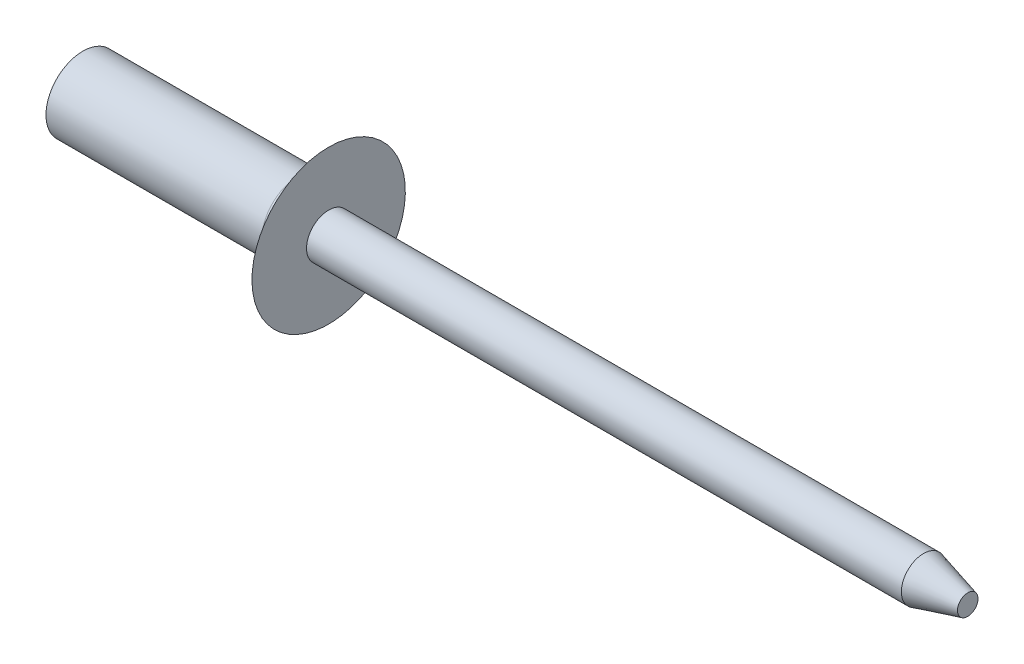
ISO-10303-21;
HEADER;
FILE_DESCRIPTION(('STEP AP214'),'2;1');
FILE_NAME('part.step','',(''),(''),'','','');
FILE_SCHEMA(('AUTOMOTIVE_DESIGN { 1 0 10303 214 1 1 1 1 }'));
ENDSEC;
DATA;
#1=APPLICATION_CONTEXT('core data for automotive mechanical design processes');
#2=APPLICATION_PROTOCOL_DEFINITION('international standard','automotive_design',2000,#1);
#3=PRODUCT_CONTEXT('',#1,'mechanical');
#4=PRODUCT('Part','Part','',(#3));
#5=PRODUCT_RELATED_PRODUCT_CATEGORY('part','',(#4));
#6=PRODUCT_DEFINITION_FORMATION('','',#4);
#7=PRODUCT_DEFINITION_CONTEXT('part definition',#1,'design');
#8=PRODUCT_DEFINITION('design','',#6,#7);
#9=PRODUCT_DEFINITION_SHAPE('','',#8);
#10=(LENGTH_UNIT() NAMED_UNIT(*) SI_UNIT(.MILLI.,.METRE.));
#11=(NAMED_UNIT(*) PLANE_ANGLE_UNIT() SI_UNIT($,.RADIAN.));
#12=(NAMED_UNIT(*) SI_UNIT($,.STERADIAN.) SOLID_ANGLE_UNIT());
#13=UNCERTAINTY_MEASURE_WITH_UNIT(LENGTH_MEASURE(1.E-05),#10,'distance_accuracy_value','');
#14=(GEOMETRIC_REPRESENTATION_CONTEXT(3) GLOBAL_UNCERTAINTY_ASSIGNED_CONTEXT((#13)) GLOBAL_UNIT_ASSIGNED_CONTEXT((#10,
#11,#12)) REPRESENTATION_CONTEXT('',''));
#15=CARTESIAN_POINT('',(0.,0.,0.));
#16=DIRECTION('',(0.,0.,1.));
#17=DIRECTION('',(1.,0.,0.));
#18=AXIS2_PLACEMENT_3D('',#15,#16,#17);
#19=CARTESIAN_POINT('',(0.,0.,0.));
#20=DIRECTION('',(1.,0.,0.));
#21=DIRECTION('',(0.,1.,0.));
#22=AXIS2_PLACEMENT_3D('',#19,#20,#21);
#23=PLANE('',#22);
#24=CARTESIAN_POINT('',(0.,0.,0.));
#25=DIRECTION('',(1.,0.,0.));
#26=DIRECTION('',(0.,1.,0.));
#27=AXIS2_PLACEMENT_3D('',#24,#25,#26);
#28=CIRCLE('',#27,1.5);
#29=CARTESIAN_POINT('',(0.,1.5,0.));
#30=VERTEX_POINT('',#29);
#31=EDGE_CURVE('E51',#30,#30,#28,.T.);
#32=ORIENTED_EDGE('',*,*,#31,.F.);
#33=EDGE_LOOP('',(#32));
#34=FACE_BOUND('',#33,.T.);
#35=ADVANCED_FACE('F31',(#34),#23,.F.);
#36=CARTESIAN_POINT('',(30.3742022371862,0.,0.));
#37=DIRECTION('',(1.,0.,0.));
#38=DIRECTION('',(0.,1.,0.));
#39=AXIS2_PLACEMENT_3D('',#36,#37,#38);
#40=CYLINDRICAL_SURFACE('',#39,1.5);
#41=CARTESIAN_POINT('',(8.77601742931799,0.,0.));
#42=DIRECTION('',(1.,0.,0.));
#43=DIRECTION('',(0.,1.,0.));
#44=AXIS2_PLACEMENT_3D('',#41,#42,#43);
#45=CIRCLE('',#44,1.5);
#46=CARTESIAN_POINT('',(8.77601742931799,1.5,0.));
#47=VERTEX_POINT('',#46);
#48=EDGE_CURVE('E42',#47,#47,#45,.F.);
#49=ORIENTED_EDGE('',*,*,#48,.T.);
#50=EDGE_LOOP('',(#49));
#51=FACE_BOUND('',#50,.T.);
#52=ORIENTED_EDGE('',*,*,#31,.T.);
#53=EDGE_LOOP('',(#52));
#54=FACE_BOUND('',#53,.T.);
#55=ADVANCED_FACE('F71',(#51,#54),#40,.T.);
#56=CARTESIAN_POINT('',(9.0646925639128,0.,0.));
#57=DIRECTION('',(1.,0.,0.));
#58=DIRECTION('',(0.,1.,0.));
#59=AXIS2_PLACEMENT_3D('',#56,#57,#58);
#60=CONICAL_SURFACE('',#59,1.5,1.04719755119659);
#61=CARTESIAN_POINT('',(9.20903013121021,0.,0.));
#62=DIRECTION('',(1.,0.,0.));
#63=DIRECTION('',(0.,1.,0.));
#64=AXIS2_PLACEMENT_3D('',#61,#62,#63);
#65=CIRCLE('',#64,1.75);
#66=CARTESIAN_POINT('',(9.20903013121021,1.75,0.));
#67=VERTEX_POINT('',#66);
#68=EDGE_CURVE('E46',#67,#67,#65,.T.);
#69=ORIENTED_EDGE('',*,*,#68,.T.);
#70=EDGE_LOOP('',(#69));
#71=FACE_BOUND('',#70,.T.);
#72=CARTESIAN_POINT('',(10.,0.,0.));
#73=DIRECTION('',(1.,0.,0.));
#74=DIRECTION('',(0.,1.,0.));
#75=AXIS2_PLACEMENT_3D('',#72,#73,#74);
#76=CIRCLE('',#75,3.12);
#77=CARTESIAN_POINT('',(10.,3.12,0.));
#78=VERTEX_POINT('',#77);
#79=EDGE_CURVE('E54',#78,#78,#76,.T.);
#80=ORIENTED_EDGE('',*,*,#79,.F.);
#81=EDGE_LOOP('',(#80));
#82=FACE_BOUND('',#81,.T.);
#83=ADVANCED_FACE('F66',(#71,#82),#60,.T.);
#84=CARTESIAN_POINT('',(10.,-3.12,0.));
#85=DIRECTION('',(-1.,0.,0.));
#86=DIRECTION('',(0.,-1.,0.));
#87=AXIS2_PLACEMENT_3D('',#84,#85,#86);
#88=PLANE('',#87);
#89=CARTESIAN_POINT('',(10.,0.,0.));
#90=DIRECTION('',(1.,0.,0.));
#91=DIRECTION('',(0.,1.,0.));
#92=AXIS2_PLACEMENT_3D('',#89,#90,#91);
#93=CIRCLE('',#92,0.900000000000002);
#94=CARTESIAN_POINT('',(10.,0.900000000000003,0.));
#95=VERTEX_POINT('',#94);
#96=EDGE_CURVE('E57',#95,#95,#93,.T.);
#97=ORIENTED_EDGE('',*,*,#96,.F.);
#98=EDGE_LOOP('',(#97));
#99=FACE_BOUND('',#98,.T.);
#100=ORIENTED_EDGE('',*,*,#79,.T.);
#101=EDGE_LOOP('',(#100));
#102=FACE_BOUND('',#101,.T.);
#103=ADVANCED_FACE('F63',(#99,#102),#88,.F.);
#104=CARTESIAN_POINT('',(30.3742022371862,0.,0.));
#105=DIRECTION('',(1.,0.,0.));
#106=DIRECTION('',(0.,1.,0.));
#107=AXIS2_PLACEMENT_3D('',#104,#105,#106);
#108=CYLINDRICAL_SURFACE('',#107,0.900000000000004);
#109=CARTESIAN_POINT('',(34.2,0.,0.));
#110=DIRECTION('',(-1.,0.,0.));
#111=DIRECTION('',(0.,-1.,0.));
#112=AXIS2_PLACEMENT_3D('',#109,#110,#111);
#113=CIRCLE('',#112,0.900000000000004);
#114=CARTESIAN_POINT('',(34.2,-0.9,0.));
#115=VERTEX_POINT('',#114);
#116=EDGE_CURVE('E10',#115,#115,#113,.T.);
#117=ORIENTED_EDGE('',*,*,#116,.T.);
#118=EDGE_LOOP('',(#117));
#119=FACE_BOUND('',#118,.T.);
#120=ORIENTED_EDGE('',*,*,#96,.T.);
#121=EDGE_LOOP('',(#120));
#122=FACE_BOUND('',#121,.T.);
#123=ADVANCED_FACE('F61',(#119,#122),#108,.T.);
#124=CARTESIAN_POINT('',(36.,-0.900000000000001,0.));
#125=DIRECTION('',(-1.,0.,0.));
#126=DIRECTION('',(0.,-1.,0.));
#127=AXIS2_PLACEMENT_3D('',#124,#125,#126);
#128=PLANE('',#127);
#129=CARTESIAN_POINT('',(36.,0.,0.));
#130=DIRECTION('',(-1.,0.,0.));
#131=DIRECTION('',(0.,-1.,0.));
#132=AXIS2_PLACEMENT_3D('',#129,#130,#131);
#133=CIRCLE('',#132,0.417691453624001);
#134=CARTESIAN_POINT('',(36.,-0.417691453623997,0.));
#135=VERTEX_POINT('',#134);
#136=EDGE_CURVE('E38',#135,#135,#133,.F.);
#137=ORIENTED_EDGE('',*,*,#136,.T.);
#138=EDGE_LOOP('',(#137));
#139=FACE_BOUND('',#138,.T.);
#140=ADVANCED_FACE('F87',(#139),#128,.F.);
#141=CARTESIAN_POINT('',(8.77601742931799,0.,0.));
#142=DIRECTION('',(1.,0.,0.));
#143=DIRECTION('',(0.,1.,0.));
#144=AXIS2_PLACEMENT_3D('',#141,#142,#143);
#145=TOROIDAL_SURFACE('',#144,2.,0.5);
#146=ORIENTED_EDGE('',*,*,#48,.F.);
#147=EDGE_LOOP('',(#146));
#148=FACE_BOUND('',#147,.T.);
#149=ORIENTED_EDGE('',*,*,#68,.F.);
#150=EDGE_LOOP('',(#149));
#151=FACE_BOUND('',#150,.T.);
#152=ADVANCED_FACE('F85',(#148,#151),#145,.F.);
#153=CARTESIAN_POINT('',(36.,0.,0.));
#154=DIRECTION('',(-1.,0.,0.));
#155=DIRECTION('',(0.,-1.,0.));
#156=AXIS2_PLACEMENT_3D('',#153,#154,#155);
#157=CONICAL_SURFACE('',#156,0.417691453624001,0.261799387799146);
#158=ORIENTED_EDGE('',*,*,#116,.F.);
#159=EDGE_LOOP('',(#158));
#160=FACE_BOUND('',#159,.T.);
#161=ORIENTED_EDGE('',*,*,#136,.F.);
#162=EDGE_LOOP('',(#161));
#163=FACE_BOUND('',#162,.T.);
#164=ADVANCED_FACE('F33',(#160,#163),#157,.T.);
#165=CLOSED_SHELL('',(#35,#55,#83,#103,#123,#140,#152,#164));
#166=MANIFOLD_SOLID_BREP('B2',#165);
#167=ADVANCED_BREP_SHAPE_REPRESENTATION('',(#18,#166),#14);
#168=SHAPE_DEFINITION_REPRESENTATION(#9,#167);
ENDSEC;
END-ISO-10303-21;
